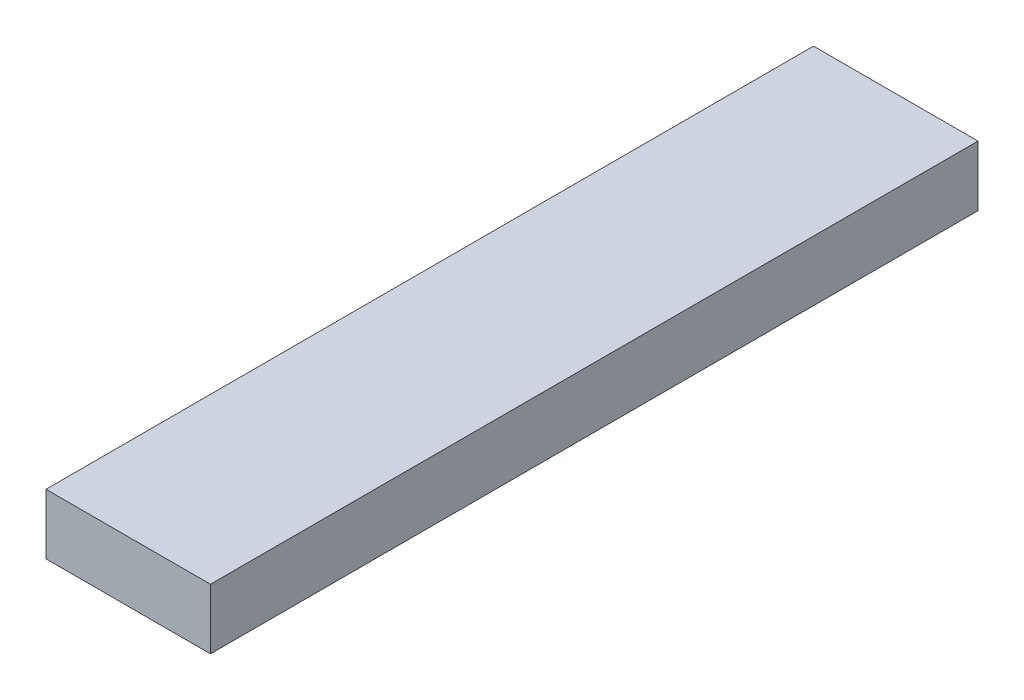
from build123d import *

# Parameters (mm, degrees)
ESQUISSE1_W          = 30
ESQUISSE1_H          = 11
BASE_EXTRUSION_DEPTH = 140


with BuildPart() as part:
    # Esquisse1 → Base-Extrusion (new body)
    with BuildSketch(Plane.XY):
        with Locations((0, -5.5)):
            Rectangle(ESQUISSE1_W, ESQUISSE1_H)
    extrude(amount=BASE_EXTRUSION_DEPTH)


solid = part.part
